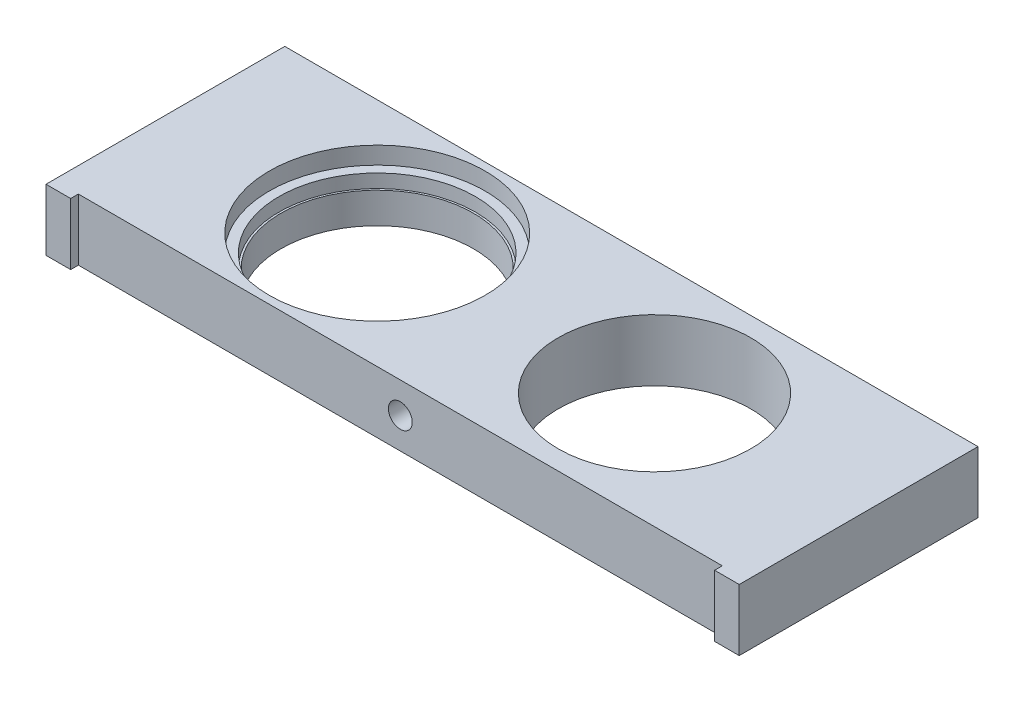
from build123d import *

# Parameters (mm, degrees)
SKETCH1_W                      = 30
SKETCH1_H                      = 8
BOSS_EXTRUDE1_DEPTH            = 45
SKETCH2_R                      = 12.5
CUT_EXTRUDE1_DEPTH             = 49.104053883
SKETCH3_R                      = 12.75
CUT_EXTRUDE2_DEPTH             = 4
SKETCH4_R                      = 14
CUT_EXTRUDE3_DEPTH             = 2.25
M3X0_5_TAPPED_HOLE1_D          = 2.5
M3X0_5_TAPPED_HOLE1_DEPTH      = 7
M3X0_5_TAPPED_HOLE1_TIP        = 0.751075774
SKETCH8_W                      = 3.2
SKETCH8_H                      = 8
BOSS_EXTRUDE2_DEPTH            = 1
F_3_1_3_1_DIAMETER_HOLE1_D     = 3.1
F_3_1_3_1_DIAMETER_HOLE1_DEPTH = 10
F_3_1_3_1_DIAMETER_HOLE1_TIP   = 0.931333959


with BuildPart() as part:
    # Sketch1 → Boss-Extrude1 (new, symmetric)
    with BuildSketch(Plane(origin=(0, 0, 0), x_dir=(0, 0, -1), z_dir=(1, 0, 0))):
        Rectangle(SKETCH1_W, SKETCH1_H)
    extrude(amount=BOSS_EXTRUDE1_DEPTH, both=True)

    # Sketch2 → Cut-Extrude1 (cut, through all)
    with BuildSketch(Plane(origin=(0, 4, 0), x_dir=(1, 0, 0), z_dir=(0, 1, 0))):
        with Locations(Location((-18, 0, 0), (0, 0, 270))):
            Circle(SKETCH2_R)
        with Locations(Location((18, 0, 0), (0, 0, 270))):
            Circle(SKETCH2_R)
    extrude(amount=-CUT_EXTRUDE1_DEPTH, mode=Mode.SUBTRACT)

    # Sketch3 → Cut-Extrude2 (cut)
    with BuildSketch(Plane(origin=(0, 4, 0), x_dir=(1, 0, 0), z_dir=(0, 1, 0))):
        with Locations(Location((-18, 0, 0), (0, 0, 270))):
            Circle(SKETCH3_R)
    extrude(amount=-CUT_EXTRUDE2_DEPTH, mode=Mode.SUBTRACT)

    # Sketch4 → Cut-Extrude3 (cut)
    with BuildSketch(Plane(origin=(0, 4, 0), x_dir=(1, 0, 0), z_dir=(0, 1, 0))):
        with Locations(Location((-18, 0, 0), (0, 0, 270))):
            Circle(SKETCH4_R)
    extrude(amount=-CUT_EXTRUDE3_DEPTH, mode=Mode.SUBTRACT)

    # M3x0.5 Tapped Hole1
    with Locations(Plane.ZY.offset(45)):
        with Locations((0, 0)):
            Hole(M3X0_5_TAPPED_HOLE1_D / 2, depth=M3X0_5_TAPPED_HOLE1_DEPTH)
            with Locations((0, 0, -(M3X0_5_TAPPED_HOLE1_DEPTH + M3X0_5_TAPPED_HOLE1_TIP / 2))):  # 118° drill point
                Cone(0, M3X0_5_TAPPED_HOLE1_D / 2, M3X0_5_TAPPED_HOLE1_TIP, mode=Mode.SUBTRACT)

    # Sketch8 → Boss-Extrude2 (add)
    with BuildSketch(Plane.XY.offset(15)):
        with Locations((-43.4, 0)):
            Rectangle(SKETCH8_W, SKETCH8_H)
        with Locations((43.4, 0)):
            Rectangle(SKETCH8_W, SKETCH8_H)
    extrude(amount=BOSS_EXTRUDE2_DEPTH)

    # 3.1 _3.1_ Diameter Hole1
    with Locations(Plane.XY.offset(15)):
        with Locations((0, 0)):
            Hole(F_3_1_3_1_DIAMETER_HOLE1_D / 2, depth=F_3_1_3_1_DIAMETER_HOLE1_DEPTH)
            with Locations((0, 0, -(F_3_1_3_1_DIAMETER_HOLE1_DEPTH + F_3_1_3_1_DIAMETER_HOLE1_TIP / 2))):  # 118° drill point
                Cone(0, F_3_1_3_1_DIAMETER_HOLE1_D / 2, F_3_1_3_1_DIAMETER_HOLE1_TIP, mode=Mode.SUBTRACT)


solid = part.part
